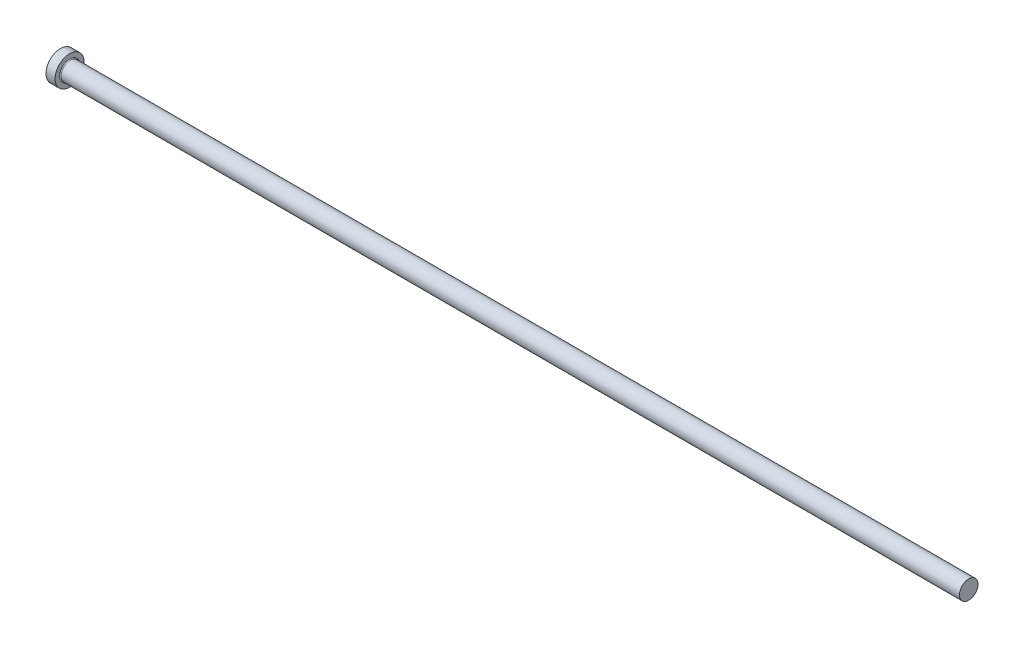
ISO-10303-21;
HEADER;
FILE_DESCRIPTION(('STEP AP214'),'2;1');
FILE_NAME('part.step','',(''),(''),'','','');
FILE_SCHEMA(('AUTOMOTIVE_DESIGN { 1 0 10303 214 1 1 1 1 }'));
ENDSEC;
DATA;
#1=APPLICATION_CONTEXT('core data for automotive mechanical design processes');
#2=APPLICATION_PROTOCOL_DEFINITION('international standard','automotive_design',2000,#1);
#3=PRODUCT_CONTEXT('',#1,'mechanical');
#4=PRODUCT('Part','Part','',(#3));
#5=PRODUCT_RELATED_PRODUCT_CATEGORY('part','',(#4));
#6=PRODUCT_DEFINITION_FORMATION('','',#4);
#7=PRODUCT_DEFINITION_CONTEXT('part definition',#1,'design');
#8=PRODUCT_DEFINITION('design','',#6,#7);
#9=PRODUCT_DEFINITION_SHAPE('','',#8);
#10=(LENGTH_UNIT() NAMED_UNIT(*) SI_UNIT(.MILLI.,.METRE.));
#11=(NAMED_UNIT(*) PLANE_ANGLE_UNIT() SI_UNIT($,.RADIAN.));
#12=(NAMED_UNIT(*) SI_UNIT($,.STERADIAN.) SOLID_ANGLE_UNIT());
#13=UNCERTAINTY_MEASURE_WITH_UNIT(LENGTH_MEASURE(1.E-05),#10,'distance_accuracy_value','');
#14=(GEOMETRIC_REPRESENTATION_CONTEXT(3) GLOBAL_UNCERTAINTY_ASSIGNED_CONTEXT((#13)) GLOBAL_UNIT_ASSIGNED_CONTEXT((#10,
#11,#12)) REPRESENTATION_CONTEXT('',''));
#15=CARTESIAN_POINT('',(0.,0.,0.));
#16=DIRECTION('',(0.,0.,1.));
#17=DIRECTION('',(1.,0.,0.));
#18=AXIS2_PLACEMENT_3D('',#15,#16,#17);
#19=CARTESIAN_POINT('',(0.,0.,0.));
#20=DIRECTION('',(-1.,0.,0.));
#21=DIRECTION('',(0.,-1.,0.));
#22=AXIS2_PLACEMENT_3D('',#19,#20,#21);
#23=PLANE('',#22);
#24=CARTESIAN_POINT('',(0.,0.,0.));
#25=DIRECTION('',(1.,0.,0.));
#26=DIRECTION('',(0.,1.,0.));
#27=AXIS2_PLACEMENT_3D('',#24,#25,#26);
#28=CIRCLE('',#27,8.);
#29=CARTESIAN_POINT('',(0.,8.,0.));
#30=VERTEX_POINT('',#29);
#31=EDGE_CURVE('E25',#30,#30,#28,.T.);
#32=ORIENTED_EDGE('',*,*,#31,.F.);
#33=EDGE_LOOP('',(#32));
#34=FACE_BOUND('',#33,.T.);
#35=ADVANCED_FACE('F14',(#34),#23,.T.);
#36=CARTESIAN_POINT('',(500.,0.,0.));
#37=DIRECTION('',(1.,0.,0.));
#38=DIRECTION('',(0.,1.,0.));
#39=AXIS2_PLACEMENT_3D('',#36,#37,#38);
#40=CYLINDRICAL_SURFACE('',#39,8.);
#41=ORIENTED_EDGE('',*,*,#31,.T.);
#42=EDGE_LOOP('',(#41));
#43=FACE_BOUND('',#42,.T.);
#44=CARTESIAN_POINT('',(5.,0.,0.));
#45=DIRECTION('',(1.,0.,0.));
#46=DIRECTION('',(0.,1.,0.));
#47=AXIS2_PLACEMENT_3D('',#44,#45,#46);
#48=CIRCLE('',#47,8.);
#49=CARTESIAN_POINT('',(5.,8.,0.));
#50=VERTEX_POINT('',#49);
#51=EDGE_CURVE('E29',#50,#50,#48,.T.);
#52=ORIENTED_EDGE('',*,*,#51,.F.);
#53=EDGE_LOOP('',(#52));
#54=FACE_BOUND('',#53,.T.);
#55=ADVANCED_FACE('F51',(#43,#54),#40,.T.);
#56=CARTESIAN_POINT('',(5.,8.,0.));
#57=DIRECTION('',(1.,0.,0.));
#58=DIRECTION('',(0.,1.,0.));
#59=AXIS2_PLACEMENT_3D('',#56,#57,#58);
#60=PLANE('',#59);
#61=CARTESIAN_POINT('',(5.,0.,0.));
#62=DIRECTION('',(1.,0.,0.));
#63=DIRECTION('',(0.,1.,0.));
#64=AXIS2_PLACEMENT_3D('',#61,#62,#63);
#65=CIRCLE('',#64,5.6);
#66=CARTESIAN_POINT('',(5.,5.6,0.));
#67=VERTEX_POINT('',#66);
#68=EDGE_CURVE('E9',#67,#67,#65,.F.);
#69=ORIENTED_EDGE('',*,*,#68,.T.);
#70=EDGE_LOOP('',(#69));
#71=FACE_BOUND('',#70,.T.);
#72=ORIENTED_EDGE('',*,*,#51,.T.);
#73=EDGE_LOOP('',(#72));
#74=FACE_BOUND('',#73,.T.);
#75=ADVANCED_FACE('F42',(#71,#74),#60,.T.);
#76=CARTESIAN_POINT('',(500.,0.,0.));
#77=DIRECTION('',(1.,0.,0.));
#78=DIRECTION('',(0.,1.,0.));
#79=AXIS2_PLACEMENT_3D('',#76,#77,#78);
#80=CYLINDRICAL_SURFACE('',#79,5.1);
#81=CARTESIAN_POINT('',(5.5,0.,0.));
#82=DIRECTION('',(1.,0.,0.));
#83=DIRECTION('',(0.,1.,0.));
#84=AXIS2_PLACEMENT_3D('',#81,#82,#83);
#85=CIRCLE('',#84,5.1);
#86=CARTESIAN_POINT('',(5.5,5.1,0.));
#87=VERTEX_POINT('',#86);
#88=EDGE_CURVE('E21',#87,#87,#85,.T.);
#89=ORIENTED_EDGE('',*,*,#88,.T.);
#90=EDGE_LOOP('',(#89));
#91=FACE_BOUND('',#90,.T.);
#92=CARTESIAN_POINT('',(500.,0.,0.));
#93=DIRECTION('',(1.,0.,0.));
#94=DIRECTION('',(0.,1.,0.));
#95=AXIS2_PLACEMENT_3D('',#92,#93,#94);
#96=CIRCLE('',#95,5.09999999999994);
#97=CARTESIAN_POINT('',(500.,5.09999999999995,0.));
#98=VERTEX_POINT('',#97);
#99=EDGE_CURVE('E34',#98,#98,#96,.T.);
#100=ORIENTED_EDGE('',*,*,#99,.F.);
#101=EDGE_LOOP('',(#100));
#102=FACE_BOUND('',#101,.T.);
#103=ADVANCED_FACE('F40',(#91,#102),#80,.T.);
#104=CARTESIAN_POINT('',(500.,5.1,0.));
#105=DIRECTION('',(1.,0.,0.));
#106=DIRECTION('',(0.,1.,0.));
#107=AXIS2_PLACEMENT_3D('',#104,#105,#106);
#108=PLANE('',#107);
#109=ORIENTED_EDGE('',*,*,#99,.T.);
#110=EDGE_LOOP('',(#109));
#111=FACE_BOUND('',#110,.T.);
#112=ADVANCED_FACE('F38',(#111),#108,.T.);
#113=CARTESIAN_POINT('',(5.5,0.,0.));
#114=DIRECTION('',(1.,0.,0.));
#115=DIRECTION('',(0.,1.,0.));
#116=AXIS2_PLACEMENT_3D('',#113,#114,#115);
#117=TOROIDAL_SURFACE('',#116,5.6,0.5);
#118=ORIENTED_EDGE('',*,*,#68,.F.);
#119=EDGE_LOOP('',(#118));
#120=FACE_BOUND('',#119,.T.);
#121=ORIENTED_EDGE('',*,*,#88,.F.);
#122=EDGE_LOOP('',(#121));
#123=FACE_BOUND('',#122,.T.);
#124=ADVANCED_FACE('F16',(#120,#123),#117,.F.);
#125=CLOSED_SHELL('',(#35,#55,#75,#103,#112,#124));
#126=MANIFOLD_SOLID_BREP('B1',#125);
#127=ADVANCED_BREP_SHAPE_REPRESENTATION('',(#18,#126),#14);
#128=SHAPE_DEFINITION_REPRESENTATION(#9,#127);
ENDSEC;
END-ISO-10303-21;
